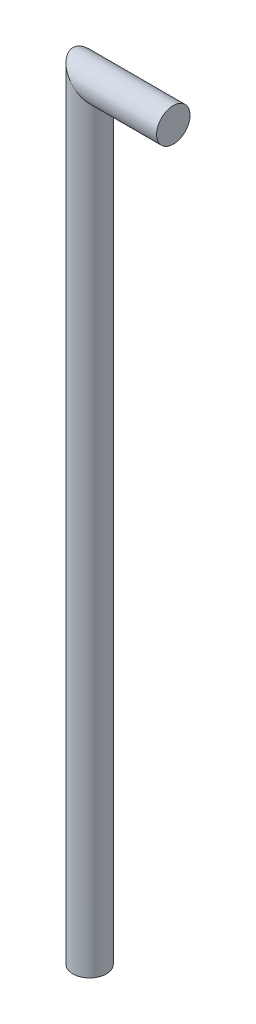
ISO-10303-21;
HEADER;
FILE_DESCRIPTION(('STEP AP214'),'2;1');
FILE_NAME('part.step','',(''),(''),'','','');
FILE_SCHEMA(('AUTOMOTIVE_DESIGN { 1 0 10303 214 1 1 1 1 }'));
ENDSEC;
DATA;
#1=APPLICATION_CONTEXT('core data for automotive mechanical design processes');
#2=APPLICATION_PROTOCOL_DEFINITION('international standard','automotive_design',2000,#1);
#3=PRODUCT_CONTEXT('',#1,'mechanical');
#4=PRODUCT('Part','Part','',(#3));
#5=PRODUCT_RELATED_PRODUCT_CATEGORY('part','',(#4));
#6=PRODUCT_DEFINITION_FORMATION('','',#4);
#7=PRODUCT_DEFINITION_CONTEXT('part definition',#1,'design');
#8=PRODUCT_DEFINITION('design','',#6,#7);
#9=PRODUCT_DEFINITION_SHAPE('','',#8);
#10=(LENGTH_UNIT() NAMED_UNIT(*) SI_UNIT(.MILLI.,.METRE.));
#11=(NAMED_UNIT(*) PLANE_ANGLE_UNIT() SI_UNIT($,.RADIAN.));
#12=(NAMED_UNIT(*) SI_UNIT($,.STERADIAN.) SOLID_ANGLE_UNIT());
#13=UNCERTAINTY_MEASURE_WITH_UNIT(LENGTH_MEASURE(1.E-05),#10,'distance_accuracy_value','');
#14=(GEOMETRIC_REPRESENTATION_CONTEXT(3) GLOBAL_UNCERTAINTY_ASSIGNED_CONTEXT((#13)) GLOBAL_UNIT_ASSIGNED_CONTEXT((#10,
#11,#12)) REPRESENTATION_CONTEXT('',''));
#15=CARTESIAN_POINT('',(0.,0.,0.));
#16=DIRECTION('',(0.,0.,1.));
#17=DIRECTION('',(1.,0.,0.));
#18=AXIS2_PLACEMENT_3D('',#15,#16,#17);
#19=CARTESIAN_POINT('',(30.,275.61,0.));
#20=DIRECTION('',(1.,0.,0.));
#21=DIRECTION('',(0.,0.,-1.));
#22=AXIS2_PLACEMENT_3D('',#19,#20,#21);
#23=PLANE('',#22);
#24=CARTESIAN_POINT('',(30.,275.61,0.));
#25=DIRECTION('',(1.,0.,0.));
#26=DIRECTION('',(0.,0.,-1.));
#27=AXIS2_PLACEMENT_3D('',#24,#25,#26);
#28=CIRCLE('',#27,5.99999999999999);
#29=CARTESIAN_POINT('',(30.,275.61,-5.99999999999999));
#30=VERTEX_POINT('',#29);
#31=EDGE_CURVE('E42',#30,#30,#28,.T.);
#32=ORIENTED_EDGE('',*,*,#31,.T.);
#33=EDGE_LOOP('',(#32));
#34=FACE_BOUND('',#33,.T.);
#35=ADVANCED_FACE('F39',(#34),#23,.T.);
#36=CARTESIAN_POINT('',(0.,0.,0.));
#37=DIRECTION('',(0.,1.,0.));
#38=DIRECTION('',(0.,0.,-1.));
#39=AXIS2_PLACEMENT_3D('',#36,#37,#38);
#40=PLANE('',#39);
#41=CARTESIAN_POINT('',(0.,0.,0.));
#42=DIRECTION('',(0.,1.,0.));
#43=DIRECTION('',(0.,0.,-1.));
#44=AXIS2_PLACEMENT_3D('',#41,#42,#43);
#45=CIRCLE('',#44,5.99999999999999);
#46=CARTESIAN_POINT('',(0.,0.,-5.99999999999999));
#47=VERTEX_POINT('',#46);
#48=EDGE_CURVE('E48',#47,#47,#45,.T.);
#49=ORIENTED_EDGE('',*,*,#48,.F.);
#50=EDGE_LOOP('',(#49));
#51=FACE_BOUND('',#50,.T.);
#52=ADVANCED_FACE('F70',(#51),#40,.F.);
#53=CARTESIAN_POINT('',(-13.3,275.61,0.));
#54=DIRECTION('',(1.,0.,0.));
#55=DIRECTION('',(0.,0.,-1.));
#56=AXIS2_PLACEMENT_3D('',#53,#54,#55);
#57=CYLINDRICAL_SURFACE('',#56,5.99999999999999);
#58=CARTESIAN_POINT('',(0.,275.61,0.));
#59=DIRECTION('',(0.707106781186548,0.707106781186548,0.));
#60=DIRECTION('',(-0.707106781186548,0.707106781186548,0.));
#61=AXIS2_PLACEMENT_3D('',#58,#59,#60);
#62=ELLIPSE('',#61,8.48528137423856,5.99999999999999);
#63=CARTESIAN_POINT('',(-5.99999999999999,281.61,0.));
#64=VERTEX_POINT('',#63);
#65=EDGE_CURVE('E11',#64,#64,#62,.F.);
#66=ORIENTED_EDGE('',*,*,#65,.F.);
#67=EDGE_LOOP('',(#66));
#68=FACE_BOUND('',#67,.T.);
#69=ORIENTED_EDGE('',*,*,#31,.F.);
#70=EDGE_LOOP('',(#69));
#71=FACE_BOUND('',#70,.T.);
#72=ADVANCED_FACE('F60',(#68,#71),#57,.T.);
#73=CARTESIAN_POINT('',(0.,0.,0.));
#74=DIRECTION('',(0.,1.,0.));
#75=DIRECTION('',(0.,0.,1.));
#76=AXIS2_PLACEMENT_3D('',#73,#74,#75);
#77=CYLINDRICAL_SURFACE('',#76,5.99999999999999);
#78=ORIENTED_EDGE('',*,*,#48,.T.);
#79=EDGE_LOOP('',(#78));
#80=FACE_BOUND('',#79,.T.);
#81=ORIENTED_EDGE('',*,*,#65,.T.);
#82=EDGE_LOOP('',(#81));
#83=FACE_BOUND('',#82,.T.);
#84=ADVANCED_FACE('F63',(#80,#83),#77,.T.);
#85=CLOSED_SHELL('',(#35,#52,#72,#84));
#86=MANIFOLD_SOLID_BREP('B2',#85);
#87=ADVANCED_BREP_SHAPE_REPRESENTATION('',(#18,#86),#14);
#88=SHAPE_DEFINITION_REPRESENTATION(#9,#87);
ENDSEC;
END-ISO-10303-21;
